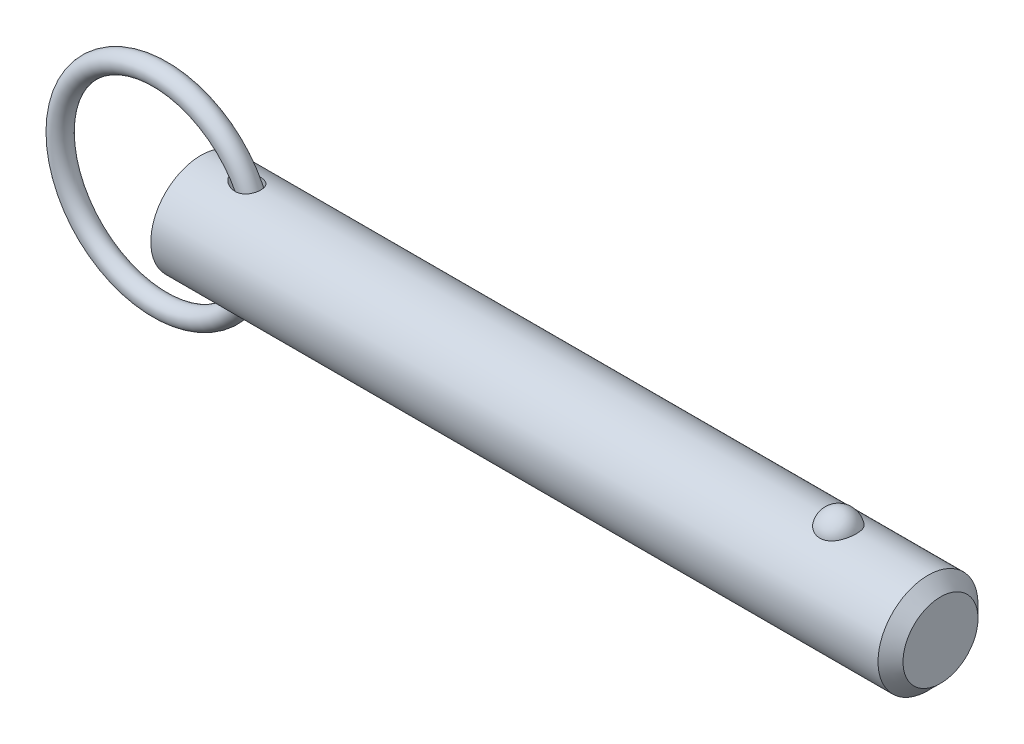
ISO-10303-21;
HEADER;
FILE_DESCRIPTION(('STEP AP214'),'2;1');
FILE_NAME('part.step','',(''),(''),'','','');
FILE_SCHEMA(('AUTOMOTIVE_DESIGN { 1 0 10303 214 1 1 1 1 }'));
ENDSEC;
DATA;
#1=APPLICATION_CONTEXT('core data for automotive mechanical design processes');
#2=APPLICATION_PROTOCOL_DEFINITION('international standard','automotive_design',2000,#1);
#3=PRODUCT_CONTEXT('',#1,'mechanical');
#4=PRODUCT('Part','Part','',(#3));
#5=PRODUCT_RELATED_PRODUCT_CATEGORY('part','',(#4));
#6=PRODUCT_DEFINITION_FORMATION('','',#4);
#7=PRODUCT_DEFINITION_CONTEXT('part definition',#1,'design');
#8=PRODUCT_DEFINITION('design','',#6,#7);
#9=PRODUCT_DEFINITION_SHAPE('','',#8);
#10=(LENGTH_UNIT() NAMED_UNIT(*) SI_UNIT(.MILLI.,.METRE.));
#11=(NAMED_UNIT(*) PLANE_ANGLE_UNIT() SI_UNIT($,.RADIAN.));
#12=(NAMED_UNIT(*) SI_UNIT($,.STERADIAN.) SOLID_ANGLE_UNIT());
#13=UNCERTAINTY_MEASURE_WITH_UNIT(LENGTH_MEASURE(1.E-05),#10,'distance_accuracy_value','');
#14=(GEOMETRIC_REPRESENTATION_CONTEXT(3) GLOBAL_UNCERTAINTY_ASSIGNED_CONTEXT((#13)) GLOBAL_UNIT_ASSIGNED_CONTEXT((#10,
#11,#12)) REPRESENTATION_CONTEXT('',''));
#15=CARTESIAN_POINT('',(0.,0.,0.));
#16=DIRECTION('',(0.,0.,1.));
#17=DIRECTION('',(1.,0.,0.));
#18=AXIS2_PLACEMENT_3D('',#15,#16,#17);
#19=CARTESIAN_POINT('',(-6.46799987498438,0.,0.));
#20=DIRECTION('',(0.,0.,1.));
#21=DIRECTION('',(1.,0.,0.));
#22=AXIS2_PLACEMENT_3D('',#19,#20,#21);
#23=TOROIDAL_SURFACE('',#22,15.875,1.588);
#24=CARTESIAN_POINT('',(10.9950001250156,0.,0.));
#25=VERTEX_POINT('',#24);
#26=VERTEX_LOOP('',#25);
#27=FACE_BOUND('',#26,.T.);
#28=ADVANCED_FACE('P0_F12',(#27),#23,.T.);
#29=CLOSED_SHELL('',(#28));
#30=MANIFOLD_SOLID_BREP('P0_B1',#29);
#31=CARTESIAN_POINT('',(0.,0.,0.));
#32=DIRECTION('',(1.,0.,0.));
#33=DIRECTION('',(0.,0.,-1.));
#34=AXIS2_PLACEMENT_3D('',#31,#32,#33);
#35=CYLINDRICAL_SURFACE('',#34,7.94);
#36=CARTESIAN_POINT('',(5.37881269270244,7.8641200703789,-1.0950869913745));
#37=CARTESIAN_POINT('',(5.49078530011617,7.84653010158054,-1.22142628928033));
#38=CARTESIAN_POINT('',(5.61742164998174,7.82766483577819,-1.33478448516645));
#39=CARTESIAN_POINT('',(5.82155225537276,7.80005811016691,-1.48501770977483));
#40=CARTESIAN_POINT('',(5.89211597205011,7.79095331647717,-1.53186949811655));
#41=CARTESIAN_POINT('',(6.03726296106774,7.77331484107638,-1.61899652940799));
#42=CARTESIAN_POINT('',(6.11184478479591,7.76478095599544,-1.65927412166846));
#43=CARTESIAN_POINT('',(6.31831542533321,7.74290334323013,-1.75933205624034));
#44=CARTESIAN_POINT('',(6.45343253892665,7.73042593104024,-1.81276183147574));
#45=CARTESIAN_POINT('',(6.73017339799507,7.70966096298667,-1.89912673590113));
#46=CARTESIAN_POINT('',(6.87179099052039,7.70136953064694,-1.93208083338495));
#47=CARTESIAN_POINT('',(7.17522096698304,7.6896684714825,-1.97820987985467));
#48=CARTESIAN_POINT('',(7.33750100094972,7.68691980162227,-1.98871513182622));
#49=CARTESIAN_POINT('',(7.5799424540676,7.68880305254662,-1.98137951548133));
#50=CARTESIAN_POINT('',(7.66059155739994,7.69043175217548,-1.97508575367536));
#51=CARTESIAN_POINT('',(7.82077465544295,7.69570110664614,-1.95445819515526));
#52=CARTESIAN_POINT('',(7.90030910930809,7.69934090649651,-1.94012781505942));
#53=CARTESIAN_POINT('',(8.092800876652,7.71066069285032,-1.89475688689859));
#54=CARTESIAN_POINT('',(8.20465204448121,7.71942251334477,-1.85909462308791));
#55=CARTESIAN_POINT('',(8.42059371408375,7.74035594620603,-1.7699066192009));
#56=CARTESIAN_POINT('',(8.52468939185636,7.75252525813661,-1.7163929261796));
#57=CARTESIAN_POINT('',(8.72211003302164,7.77903750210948,-1.59192358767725));
#58=CARTESIAN_POINT('',(8.81539818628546,7.79338749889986,-1.52091076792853));
#59=CARTESIAN_POINT('',(8.98759177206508,7.8225086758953,-1.36321590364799));
#60=CARTESIAN_POINT('',(9.06649712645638,7.83727985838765,-1.27653377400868));
#61=CARTESIAN_POINT('',(9.20311499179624,7.86453692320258,-1.09567667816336));
#62=CARTESIAN_POINT('',(9.26180839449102,7.8771064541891,-1.00225329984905));
#63=CARTESIAN_POINT('',(9.36257622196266,7.89954213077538,-0.806547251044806));
#64=CARTESIAN_POINT('',(9.40465301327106,7.9094086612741,-0.704265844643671));
#65=CARTESIAN_POINT('',(9.47062404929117,7.92520709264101,-0.495461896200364));
#66=CARTESIAN_POINT('',(9.4947881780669,7.9311972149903,-0.38902885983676));
#67=CARTESIAN_POINT('',(9.52544004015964,7.93883641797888,-0.17349446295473));
#68=CARTESIAN_POINT('',(9.53192786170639,7.94048552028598,-0.0643931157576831));
#69=CARTESIAN_POINT('',(9.52707996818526,7.93926454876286,0.153487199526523));
#70=CARTESIAN_POINT('',(9.51572796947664,7.93639034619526,0.262265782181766));
#71=CARTESIAN_POINT('',(9.47542322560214,7.92642470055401,0.47631311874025));
#72=CARTESIAN_POINT('',(9.44647056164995,7.91933327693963,0.581581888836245));
#73=CARTESIAN_POINT('',(9.37164011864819,7.90170355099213,0.785602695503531));
#74=CARTESIAN_POINT('',(9.32576415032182,7.89116561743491,0.884355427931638));
#75=CARTESIAN_POINT('',(9.21823065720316,7.8677977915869,1.07254831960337));
#76=CARTESIAN_POINT('',(9.15657431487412,7.85496807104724,1.16198917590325));
#77=CARTESIAN_POINT('',(9.01919194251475,7.82843688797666,1.32903649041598));
#78=CARTESIAN_POINT('',(8.94347744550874,7.81473614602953,1.40665255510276));
#79=CARTESIAN_POINT('',(8.78012086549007,7.7879321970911,1.5481977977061));
#80=CARTESIAN_POINT('',(8.69247914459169,7.77482897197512,1.61212739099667));
#81=CARTESIAN_POINT('',(8.50642314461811,7.75037063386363,1.72592270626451));
#82=CARTESIAN_POINT('',(8.40786430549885,7.73904540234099,1.77555777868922));
#83=CARTESIAN_POINT('',(8.20398708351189,7.71943979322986,1.85894844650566));
#84=CARTESIAN_POINT('',(8.0986670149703,7.7111601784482,1.89270006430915));
#85=CARTESIAN_POINT('',(7.87703213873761,7.69782475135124,1.94625652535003));
#86=CARTESIAN_POINT('',(7.76044899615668,7.69301557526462,1.96500324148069));
#87=CARTESIAN_POINT('',(7.52574256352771,7.68770484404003,1.98567257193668));
#88=CARTESIAN_POINT('',(7.40761868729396,7.68720497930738,1.98758858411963));
#89=CARTESIAN_POINT('',(7.15639592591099,7.69044495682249,1.97502233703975));
#90=CARTESIAN_POINT('',(7.02341871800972,7.69476380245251,1.9583009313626));
#91=CARTESIAN_POINT('',(6.76125891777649,7.70776394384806,1.90648094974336));
#92=CARTESIAN_POINT('',(6.63208047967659,7.71644984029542,1.87136299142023));
#93=CARTESIAN_POINT('',(6.35978215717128,7.73875442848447,1.77707737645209));
#94=CARTESIAN_POINT('',(6.2177212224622,7.75293863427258,1.71496895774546));
#95=CARTESIAN_POINT('',(5.94559201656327,7.78383102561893,1.56880760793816));
#96=CARTESIAN_POINT('',(5.81552062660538,7.80053855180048,1.48476040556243));
#97=CARTESIAN_POINT('',(5.60081087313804,7.83035955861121,1.31701356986));
#98=CARTESIAN_POINT('',(5.51265224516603,7.84340226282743,1.23780647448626));
#99=CARTESIAN_POINT('',(5.34976240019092,7.86852524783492,1.06647953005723));
#100=CARTESIAN_POINT('',(5.27500719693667,7.88060722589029,0.974383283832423));
#101=CARTESIAN_POINT('',(5.15877594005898,7.89990441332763,0.800548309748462));
#102=CARTESIAN_POINT('',(5.11360209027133,7.90759876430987,0.721348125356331));
#103=CARTESIAN_POINT('',(5.03655060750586,7.92090267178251,0.556518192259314));
#104=CARTESIAN_POINT('',(5.00466157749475,7.92651401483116,0.470894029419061));
#105=CARTESIAN_POINT('',(4.95653766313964,7.93503671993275,0.294356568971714));
#106=CARTESIAN_POINT('',(4.94043621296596,7.93792505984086,0.203404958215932));
#107=CARTESIAN_POINT('',(4.92605720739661,7.94050250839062,0.0200631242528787));
#108=CARTESIAN_POINT('',(4.92776929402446,7.9401934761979,-0.0723262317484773));
#109=CARTESIAN_POINT('',(4.94742735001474,7.93667454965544,-0.243250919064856));
#110=CARTESIAN_POINT('',(4.96327131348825,7.93384031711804,-0.322048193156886));
#111=CARTESIAN_POINT('',(5.00707570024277,7.92609115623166,-0.476058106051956));
#112=CARTESIAN_POINT('',(5.03503965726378,7.92117562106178,-0.55126969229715));
#113=CARTESIAN_POINT('',(5.10737112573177,7.90866290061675,-0.709995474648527));
#114=CARTESIAN_POINT('',(5.15379379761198,7.90074105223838,-0.792541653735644));
#115=CARTESIAN_POINT('',(5.25820836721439,7.88338732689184,-0.949781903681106));
#116=CARTESIAN_POINT('',(5.31621941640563,7.87395295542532,-1.02446265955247));
#117=CARTESIAN_POINT('',(5.37881269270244,7.8641200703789,-1.0950869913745));
#118=B_SPLINE_CURVE_WITH_KNOTS('',3,(#36,#37,#38,#39,#40,#41,#42,#43,#44,#45,#46,#47,#48,#49,
#50,#51,#52,#53,#54,#55,#56,#57,#58,#59,#60,#61,#62,#63,#64,#65,#66,#67,#68,#69,#70,#71,#72,#73,
#74,#75,#76,#77,#78,#79,#80,#81,#82,#83,#84,#85,#86,#87,#88,#89,#90,#91,#92,#93,#94,#95,#96,#97,
#98,#99,#100,#101,#102,#103,#104,#105,#106,#107,#108,#109,#110,#111,#112,#113,#114,#115,#116,
#117),.UNSPECIFIED.,.T.,.F.,(4,2,2,2,2,2,2,2,2,2,2,2,2,2,2,2,2,2,2,2,2,2,2,2,2,2,2,2,2,2,2,2,2,
2,2,2,2,2,2,2,4),(0.,0.508599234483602,0.763935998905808,1.01918131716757,1.45492798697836,
1.89027038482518,2.37502798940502,2.61739702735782,2.8596631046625,3.21120678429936,
3.56251370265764,3.91498401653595,4.26745624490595,4.59897839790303,4.93045331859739,
5.25682643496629,5.58319792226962,5.909867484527,6.23653553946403,6.56316865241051,
6.88977729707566,7.21611917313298,7.54245114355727,7.87378632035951,8.20520442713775,
8.55832700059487,8.91158808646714,9.31234018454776,9.71351536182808,10.1786231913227,
10.6436096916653,11.0001264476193,11.3559986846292,11.6294791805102,11.9027245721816,
12.1782599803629,12.4536351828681,12.693828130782,12.9340911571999,13.2179277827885,
13.5022374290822),.UNSPECIFIED.);
#119=CARTESIAN_POINT('',(5.37881269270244,7.8641200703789,-1.0950869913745));
#120=VERTEX_POINT('',#119);
#121=EDGE_CURVE('P1_E40',#120,#120,#118,.T.);
#122=ORIENTED_EDGE('',*,*,#121,.T.);
#123=EDGE_LOOP('',(#122));
#124=FACE_BOUND('',#123,.T.);
#125=CARTESIAN_POINT('',(115.495,0.,0.));
#126=DIRECTION('',(1.,0.,0.));
#127=DIRECTION('',(0.,0.,-1.));
#128=AXIS2_PLACEMENT_3D('',#125,#126,#127);
#129=CIRCLE('',#128,7.94);
#130=CARTESIAN_POINT('',(115.495,0.,-7.94));
#131=VERTEX_POINT('',#130);
#132=EDGE_CURVE('P1_E25',#131,#131,#129,.T.);
#133=ORIENTED_EDGE('',*,*,#132,.F.);
#134=EDGE_LOOP('',(#133));
#135=FACE_BOUND('',#134,.T.);
#136=CARTESIAN_POINT('',(0.,0.,0.));
#137=DIRECTION('',(1.,0.,0.));
#138=DIRECTION('',(0.,0.,-1.));
#139=AXIS2_PLACEMENT_3D('',#136,#137,#138);
#140=CIRCLE('',#139,7.94);
#141=CARTESIAN_POINT('',(0.,0.,-7.94));
#142=VERTEX_POINT('',#141);
#143=EDGE_CURVE('P1_E9',#142,#142,#140,.T.);
#144=ORIENTED_EDGE('',*,*,#143,.T.);
#145=EDGE_LOOP('',(#144));
#146=FACE_BOUND('',#145,.T.);
#147=CARTESIAN_POINT('',(101.264907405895,7.37767842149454,2.93486986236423));
#148=CARTESIAN_POINT('',(101.112749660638,7.3776732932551,2.93487505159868));
#149=CARTESIAN_POINT('',(100.960632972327,7.38258419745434,2.92262454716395));
#150=CARTESIAN_POINT('',(100.660928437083,7.40163229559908,2.87404196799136));
#151=CARTESIAN_POINT('',(100.513339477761,7.41576720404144,2.83771585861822));
#152=CARTESIAN_POINT('',(100.227018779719,7.4516157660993,2.74218769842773));
#153=CARTESIAN_POINT('',(100.088274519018,7.47331841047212,2.68301886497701));
#154=CARTESIAN_POINT('',(99.8228822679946,7.52194082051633,2.54350967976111));
#155=CARTESIAN_POINT('',(99.6962366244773,7.5488615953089,2.46316523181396));
#156=CARTESIAN_POINT('',(99.4545349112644,7.60594671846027,2.2809037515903));
#157=CARTESIAN_POINT('',(99.3399065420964,7.63618114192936,2.17844211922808));
#158=CARTESIAN_POINT('',(99.1288787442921,7.69614046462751,1.95608495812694));
#159=CARTESIAN_POINT('',(99.0324826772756,7.72586526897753,1.83618622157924));
#160=CARTESIAN_POINT('',(98.8559381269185,7.78314821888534,1.57628086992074));
#161=CARTESIAN_POINT('',(98.7767072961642,7.81055035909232,1.43561546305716));
#162=CARTESIAN_POINT('',(98.6417979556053,7.85879631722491,1.14236334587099));
#163=CARTESIAN_POINT('',(98.5861216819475,7.87963951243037,0.989775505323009));
#164=CARTESIAN_POINT('',(98.4988121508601,7.91289645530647,0.674619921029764));
#165=CARTESIAN_POINT('',(98.4675309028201,7.925186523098,0.511941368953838));
#166=CARTESIAN_POINT('',(98.430975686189,7.93958930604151,0.183247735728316));
#167=CARTESIAN_POINT('',(98.4257012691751,7.94170219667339,0.0172327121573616));
#168=CARTESIAN_POINT('',(98.4412311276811,7.93554931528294,-0.312672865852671));
#169=CARTESIAN_POINT('',(98.4619253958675,7.92732732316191,-0.4765694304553));
#170=CARTESIAN_POINT('',(98.5287865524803,7.90141534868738,-0.798305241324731));
#171=CARTESIAN_POINT('',(98.5749539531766,7.88372517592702,-0.956144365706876));
#172=CARTESIAN_POINT('',(98.6918986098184,7.84066230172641,-1.26152073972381));
#173=CARTESIAN_POINT('',(98.7627046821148,7.81528060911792,-1.40904568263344));
#174=CARTESIAN_POINT('',(98.9274789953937,7.7594867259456,-1.68950598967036));
#175=CARTESIAN_POINT('',(99.0214488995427,7.72907417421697,-1.82244030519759));
#176=CARTESIAN_POINT('',(99.2308391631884,7.66640424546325,-2.07032792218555));
#177=CARTESIAN_POINT('',(99.3463152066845,7.63414223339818,-2.1852330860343));
#178=CARTESIAN_POINT('',(99.5959006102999,7.57149681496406,-2.39329737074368));
#179=CARTESIAN_POINT('',(99.7300080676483,7.54111321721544,-2.48645870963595));
#180=CARTESIAN_POINT('',(100.010111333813,7.48650742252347,-2.64628132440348));
#181=CARTESIAN_POINT('',(100.155760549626,7.46215900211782,-2.71350554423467));
#182=CARTESIAN_POINT('',(100.457425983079,7.42171253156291,-2.82226614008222));
#183=CARTESIAN_POINT('',(100.613438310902,7.40561140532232,-2.86381209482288));
#184=CARTESIAN_POINT('',(100.922970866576,7.3842679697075,-2.9183907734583));
#185=CARTESIAN_POINT('',(101.076222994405,7.37852109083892,-2.93275024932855));
#186=CARTESIAN_POINT('',(101.383070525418,7.37700973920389,-2.93655208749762));
#187=CARTESIAN_POINT('',(101.536665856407,7.38124333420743,-2.92599927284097));
#188=CARTESIAN_POINT('',(101.834990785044,7.39890635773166,-2.88102897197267));
#189=CARTESIAN_POINT('',(101.979848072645,7.41205491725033,-2.84733999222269));
#190=CARTESIAN_POINT('',(102.26164329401,7.445801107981,-2.75788206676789));
#191=CARTESIAN_POINT('',(102.398580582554,7.46639934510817,-2.70211132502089));
#192=CARTESIAN_POINT('',(102.664061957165,7.51339098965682,-2.56858908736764));
#193=CARTESIAN_POINT('',(102.792354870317,7.53990200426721,-2.49038067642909));
#194=CARTESIAN_POINT('',(103.034244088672,7.59569503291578,-2.31462737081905));
#195=CARTESIAN_POINT('',(103.147837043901,7.62497767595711,-2.21707808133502));
#196=CARTESIAN_POINT('',(103.36322156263,7.68489473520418,-1.99982049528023));
#197=CARTESIAN_POINT('',(103.464148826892,7.71552419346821,-1.87925337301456));
#198=CARTESIAN_POINT('',(103.645186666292,7.77353016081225,-1.62268826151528));
#199=CARTESIAN_POINT('',(103.725293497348,7.80090608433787,-1.4866875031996));
#200=CARTESIAN_POINT('',(103.865361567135,7.85047992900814,-1.19818413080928));
#201=CARTESIAN_POINT('',(103.924587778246,7.8724818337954,-1.04529016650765));
#202=CARTESIAN_POINT('',(104.017982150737,7.90785114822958,-0.731080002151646));
#203=CARTESIAN_POINT('',(104.052149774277,7.92121837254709,-0.569763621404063));
#204=CARTESIAN_POINT('',(104.094795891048,7.93797834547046,-0.242812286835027));
#205=CARTESIAN_POINT('',(104.103204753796,7.94134405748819,-0.0771668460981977));
#206=CARTESIAN_POINT('',(104.093962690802,7.93767937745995,0.253276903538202));
#207=CARTESIAN_POINT('',(104.076312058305,7.93064910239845,0.418075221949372));
#208=CARTESIAN_POINT('',(104.015424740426,7.90695571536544,0.741525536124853));
#209=CARTESIAN_POINT('',(103.972281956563,7.8903279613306,0.900197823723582));
#210=CARTESIAN_POINT('',(103.86135358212,7.84916386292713,1.20759654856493));
#211=CARTESIAN_POINT('',(103.79356656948,7.82462706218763,1.35632241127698));
#212=CARTESIAN_POINT('',(103.634371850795,7.7700669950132,1.64032869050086));
#213=CARTESIAN_POINT('',(103.542861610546,7.7400200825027,1.77554712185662));
#214=CARTESIAN_POINT('',(103.338296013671,7.67774175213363,2.02800648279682));
#215=CARTESIAN_POINT('',(103.225241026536,7.64551037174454,2.14524772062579));
#216=CARTESIAN_POINT('',(102.980831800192,7.58265895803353,2.35778002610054));
#217=CARTESIAN_POINT('',(102.849583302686,7.55203092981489,2.45319004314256));
#218=CARTESIAN_POINT('',(102.571601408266,7.49579792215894,2.61999897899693));
#219=CARTESIAN_POINT('',(102.424867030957,7.47019326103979,2.69139637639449));
#220=CARTESIAN_POINT('',(102.112947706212,7.42622216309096,2.8105324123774));
#221=CARTESIAN_POINT('',(101.947220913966,7.40825002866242,2.85700910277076));
#222=CARTESIAN_POINT('',(101.609279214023,7.38398348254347,2.9191685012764));
#223=CARTESIAN_POINT('',(101.43706702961,7.3776842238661,2.93486399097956));
#224=CARTESIAN_POINT('',(101.264907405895,7.37767842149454,2.93486986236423));
#225=B_SPLINE_CURVE_WITH_KNOTS('',3,(#147,#148,#149,#150,#151,#152,#153,#154,#155,#156,#157,
#158,#159,#160,#161,#162,#163,#164,#165,#166,#167,#168,#169,#170,#171,#172,#173,#174,#175,#176,
#177,#178,#179,#180,#181,#182,#183,#184,#185,#186,#187,#188,#189,#190,#191,#192,#193,#194,#195,
#196,#197,#198,#199,#200,#201,#202,#203,#204,#205,#206,#207,#208,#209,#210,#211,#212,#213,#214,
#215,#216,#217,#218,#219,#220,#221,#222,#223,#224),.UNSPECIFIED.,.T.,.F.,(4,2,2,2,2,2,2,2,2,2,2,
2,2,2,2,2,2,2,2,2,2,2,2,2,2,2,2,2,2,2,2,2,2,2,2,2,2,2,4),(0.,0.45584132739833,0.911569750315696,
1.36663794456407,1.8217942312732,2.28978983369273,2.7578716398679,3.246853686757,
3.73588214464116,4.23184282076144,4.72779494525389,5.22165321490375,5.71552141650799,
6.20996917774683,6.70445245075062,7.20023431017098,7.69596557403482,8.18023418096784,
8.66432203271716,9.12410697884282,9.58380291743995,10.0296503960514,10.4755341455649,
10.9312349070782,11.3870393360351,11.8654416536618,12.3439299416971,12.8378875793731,
13.3318558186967,13.8271581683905,14.3224549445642,14.8159385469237,15.3094506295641,
15.8051323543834,16.3008055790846,16.7937101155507,17.2866458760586,17.8026240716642,
18.3183879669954),.UNSPECIFIED.);
#226=CARTESIAN_POINT('',(101.264907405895,7.37767842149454,2.93486986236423));
#227=VERTEX_POINT('',#226);
#228=EDGE_CURVE('P1_E34',#227,#227,#225,.T.);
#229=ORIENTED_EDGE('',*,*,#228,.T.);
#230=EDGE_LOOP('',(#229));
#231=FACE_BOUND('',#230,.T.);
#232=CARTESIAN_POINT('',(5.37881269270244,-7.8641200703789,-1.0950869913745));
#233=CARTESIAN_POINT('',(5.31532711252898,-7.87409326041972,-1.02345575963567));
#234=CARTESIAN_POINT('',(5.25654962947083,-7.88365715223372,-0.947641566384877));
#235=CARTESIAN_POINT('',(5.15093536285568,-7.90122221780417,-0.787865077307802));
#236=CARTESIAN_POINT('',(5.10408931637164,-7.90922460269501,-0.703909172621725));
#237=CARTESIAN_POINT('',(5.02499142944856,-7.92292057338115,-0.5279916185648));
#238=CARTESIAN_POINT('',(4.99290048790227,-7.92858863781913,-0.435954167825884));
#239=CARTESIAN_POINT('',(4.94718343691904,-7.93670712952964,-0.247266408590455));
#240=CARTESIAN_POINT('',(4.93353142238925,-7.93916207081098,-0.150622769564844));
#241=CARTESIAN_POINT('',(4.92669426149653,-7.94038957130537,0.0306459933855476));
#242=CARTESIAN_POINT('',(4.9310562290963,-7.93960347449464,0.115182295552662));
#243=CARTESIAN_POINT('',(4.95441758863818,-7.93542535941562,0.2821331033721));
#244=CARTESIAN_POINT('',(4.97342060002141,-7.93203269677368,0.364547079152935));
#245=CARTESIAN_POINT('',(5.02337664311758,-7.92322764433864,0.521528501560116));
#246=CARTESIAN_POINT('',(5.05377582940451,-7.91790920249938,0.596281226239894));
#247=CARTESIAN_POINT('',(5.1246872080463,-7.90571364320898,0.740640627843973));
#248=CARTESIAN_POINT('',(5.16520358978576,-7.89883588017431,0.810245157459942));
#249=CARTESIAN_POINT('',(5.27792634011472,-7.88012470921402,0.97862022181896));
#250=CARTESIAN_POINT('',(5.35563200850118,-7.86757912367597,1.07363778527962));
#251=CARTESIAN_POINT('',(5.52523836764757,-7.84150676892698,1.24994147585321));
#252=CARTESIAN_POINT('',(5.61717506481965,-7.82797755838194,1.33119164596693));
#253=CARTESIAN_POINT('',(5.83913717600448,-7.79742756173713,1.50104748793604));
#254=CARTESIAN_POINT('',(5.97257429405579,-7.78050347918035,1.58521567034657));
#255=CARTESIAN_POINT('',(6.25160600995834,-7.74942135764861,1.73078109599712));
#256=CARTESIAN_POINT('',(6.39720857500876,-7.73526515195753,1.79216327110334));
#257=CARTESIAN_POINT('',(6.69793322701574,-7.7116170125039,1.89134478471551));
#258=CARTESIAN_POINT('',(6.85312134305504,-7.70216275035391,1.92895428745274));
#259=CARTESIAN_POINT('',(7.16781951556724,-7.68988337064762,1.97736316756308));
#260=CARTESIAN_POINT('',(7.32732244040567,-7.68704791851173,1.98820434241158));
#261=CARTESIAN_POINT('',(7.61290770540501,-7.68890797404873,1.98097687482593));
#262=CARTESIAN_POINT('',(7.73913797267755,-7.69217875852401,1.96837928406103));
#263=CARTESIAN_POINT('',(7.98774248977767,-7.70364253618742,1.92303262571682));
#264=CARTESIAN_POINT('',(8.11011880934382,-7.71183283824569,1.89029457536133));
#265=CARTESIAN_POINT('',(8.34766306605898,-7.73253074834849,1.80375920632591));
#266=CARTESIAN_POINT('',(8.46278682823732,-7.74506226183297,1.74984505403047));
#267=CARTESIAN_POINT('',(8.6806268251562,-7.77294147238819,1.62149891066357));
#268=CARTESIAN_POINT('',(8.78334736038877,-7.78828818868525,1.54707406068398));
#269=CARTESIAN_POINT('',(8.96275951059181,-7.81808719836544,1.38814746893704));
#270=CARTESIAN_POINT('',(9.04102925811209,-7.83247448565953,1.30540890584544));
#271=CARTESIAN_POINT('',(9.18176824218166,-7.86008608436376,1.1272733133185));
#272=CARTESIAN_POINT('',(9.24424163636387,-7.87331070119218,1.03187962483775));
#273=CARTESIAN_POINT('',(9.34924815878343,-7.89649032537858,0.83568428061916));
#274=CARTESIAN_POINT('',(9.39252490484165,-7.90656172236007,0.735293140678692));
#275=CARTESIAN_POINT('',(9.46188913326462,-7.92307290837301,0.528458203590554));
#276=CARTESIAN_POINT('',(9.48797767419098,-7.92951292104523,0.422014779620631));
#277=CARTESIAN_POINT('',(9.52228670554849,-7.93804067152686,0.206589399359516));
#278=CARTESIAN_POINT('',(9.53058328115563,-7.94014694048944,0.0976202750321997));
#279=CARTESIAN_POINT('',(9.52935292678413,-7.93983698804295,-0.120212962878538));
#280=CARTESIAN_POINT('',(9.51982577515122,-7.93742071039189,-0.229077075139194));
#281=CARTESIAN_POINT('',(9.48313466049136,-7.92831916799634,-0.443751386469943));
#282=CARTESIAN_POINT('',(9.45594838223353,-7.92162850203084,-0.549557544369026));
#283=CARTESIAN_POINT('',(9.38454658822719,-7.90469917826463,-0.754954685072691));
#284=CARTESIAN_POINT('',(9.34033171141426,-7.89446065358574,-0.854545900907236));
#285=CARTESIAN_POINT('',(9.23602927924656,-7.87157146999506,-1.04456732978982));
#286=CARTESIAN_POINT('',(9.17596171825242,-7.85892385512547,-1.13500888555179));
#287=CARTESIAN_POINT('',(9.0415343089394,-7.83259746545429,-1.30436780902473));
#288=CARTESIAN_POINT('',(8.96717562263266,-7.81891877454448,-1.38328611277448));
#289=CARTESIAN_POINT('',(8.80603455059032,-7.79196869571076,-1.52782923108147));
#290=CARTESIAN_POINT('',(8.71921490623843,-7.77869867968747,-1.59341269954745));
#291=CARTESIAN_POINT('',(8.53589430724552,-7.7539823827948,-1.7096493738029));
#292=CARTESIAN_POINT('',(8.43939269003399,-7.74253622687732,-1.76030155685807));
#293=CARTESIAN_POINT('',(8.23614706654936,-7.72219212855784,-1.84754820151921));
#294=CARTESIAN_POINT('',(8.1291686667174,-7.71339202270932,-1.88361685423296));
#295=CARTESIAN_POINT('',(7.91082287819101,-7.69955300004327,-1.93940887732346));
#296=CARTESIAN_POINT('',(7.79945379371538,-7.69451555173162,-1.95912586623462));
#297=CARTESIAN_POINT('',(7.56409927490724,-7.6881073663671,-1.98413612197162));
#298=CARTESIAN_POINT('',(7.43993744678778,-7.68713944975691,-1.98784574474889));
#299=CARTESIAN_POINT('',(7.19239878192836,-7.68969629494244,-1.97792309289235));
#300=CARTESIAN_POINT('',(7.0690222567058,-7.69322274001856,-1.96428432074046));
#301=CARTESIAN_POINT('',(6.80624991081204,-7.70498367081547,-1.91768089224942));
#302=CARTESIAN_POINT('',(6.66736121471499,-7.71386737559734,-1.88203087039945));
#303=CARTESIAN_POINT('',(6.39625444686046,-7.73551250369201,-1.79098714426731));
#304=CARTESIAN_POINT('',(6.26404857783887,-7.74828074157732,-1.73555871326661));
#305=CARTESIAN_POINT('',(6.06559048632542,-7.77003865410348,-1.63446133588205));
#306=CARTESIAN_POINT('',(5.99591479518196,-7.77821880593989,-1.59522999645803));
#307=CARTESIAN_POINT('',(5.86025875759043,-7.79503524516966,-1.51091846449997));
#308=CARTESIAN_POINT('',(5.79427944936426,-7.8036716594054,-1.46583664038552));
#309=CARTESIAN_POINT('',(5.60322733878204,-7.82978128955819,-1.3219827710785));
#310=CARTESIAN_POINT('',(5.4844964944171,-7.84751780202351,-1.21433077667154));
#311=CARTESIAN_POINT('',(5.37881269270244,-7.8641200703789,-1.0950869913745));
#312=B_SPLINE_CURVE_WITH_KNOTS('',3,(#232,#233,#234,#235,#236,#237,#238,#239,#240,#241,#242,
#243,#244,#245,#246,#247,#248,#249,#250,#251,#252,#253,#254,#255,#256,#257,#258,#259,#260,#261,
#262,#263,#264,#265,#266,#267,#268,#269,#270,#271,#272,#273,#274,#275,#276,#277,#278,#279,#280,
#281,#282,#283,#284,#285,#286,#287,#288,#289,#290,#291,#292,#293,#294,#295,#296,#297,#298,#299,
#300,#301,#302,#303,#304,#305,#306,#307,#308,#309,#310,#311),.UNSPECIFIED.,.T.,.F.,(4,2,2,2,2,2,
2,2,2,2,2,2,2,2,2,2,2,2,2,2,2,2,2,2,2,2,2,2,2,2,2,2,2,2,2,2,2,2,2,4),(0.,0.288363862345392,
0.576503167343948,0.867714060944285,1.15851540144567,1.41111828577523,1.66378363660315,
1.90549406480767,2.1473047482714,2.51540453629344,2.88445136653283,3.35805159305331,
3.83196445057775,4.30961543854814,4.78652012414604,5.16565662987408,5.54458592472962,
5.92563591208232,6.30655339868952,6.64920782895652,6.99177197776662,7.31956587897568,
7.64733959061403,7.97370879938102,8.30008206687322,8.62686856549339,8.95364280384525,
9.28000684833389,9.60634436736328,9.93367879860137,10.261035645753,10.59932199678,
10.9377403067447,11.308967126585,11.6803330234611,12.1096921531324,12.5398088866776,
12.7806650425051,13.0215885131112,13.5016249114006),.UNSPECIFIED.);
#313=CARTESIAN_POINT('',(5.37881269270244,-7.8641200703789,-1.0950869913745));
#314=VERTEX_POINT('',#313);
#315=EDGE_CURVE('P1_E17',#314,#314,#312,.T.);
#316=ORIENTED_EDGE('',*,*,#315,.T.);
#317=EDGE_LOOP('',(#316));
#318=FACE_BOUND('',#317,.T.);
#319=ADVANCED_FACE('P1_F13',(#124,#135,#146,#231,#318),#35,.T.);
#320=CARTESIAN_POINT('',(0.,0.,0.));
#321=DIRECTION('',(-1.,0.,0.));
#322=DIRECTION('',(0.,0.,1.));
#323=AXIS2_PLACEMENT_3D('',#320,#321,#322);
#324=PLANE('',#323);
#325=ORIENTED_EDGE('',*,*,#143,.F.);
#326=EDGE_LOOP('',(#325));
#327=FACE_BOUND('',#326,.T.);
#328=ADVANCED_FACE('P1_F15',(#327),#324,.T.);
#329=CARTESIAN_POINT('',(117.48,0.,0.));
#330=DIRECTION('',(-1.,0.,0.));
#331=DIRECTION('',(0.,0.,1.));
#332=AXIS2_PLACEMENT_3D('',#329,#330,#331);
#333=CONICAL_SURFACE('',#332,5.95500000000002,0.785398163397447);
#334=ORIENTED_EDGE('',*,*,#132,.T.);
#335=EDGE_LOOP('',(#334));
#336=FACE_BOUND('',#335,.T.);
#337=CARTESIAN_POINT('',(117.48,0.,0.));
#338=DIRECTION('',(1.,0.,0.));
#339=DIRECTION('',(0.,0.,-1.));
#340=AXIS2_PLACEMENT_3D('',#337,#338,#339);
#341=CIRCLE('',#340,5.95500000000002);
#342=CARTESIAN_POINT('',(117.48,0.,-5.95500000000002));
#343=VERTEX_POINT('',#342);
#344=EDGE_CURVE('P1_E30',#343,#343,#341,.T.);
#345=ORIENTED_EDGE('',*,*,#344,.F.);
#346=EDGE_LOOP('',(#345));
#347=FACE_BOUND('',#346,.T.);
#348=ADVANCED_FACE('P1_F55',(#336,#347),#333,.T.);
#349=CARTESIAN_POINT('',(117.48,5.95500000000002,0.));
#350=DIRECTION('',(1.,0.,0.));
#351=DIRECTION('',(0.,0.,-1.));
#352=AXIS2_PLACEMENT_3D('',#349,#350,#351);
#353=PLANE('',#352);
#354=ORIENTED_EDGE('',*,*,#344,.T.);
#355=EDGE_LOOP('',(#354));
#356=FACE_BOUND('',#355,.T.);
#357=ADVANCED_FACE('P1_F51',(#356),#353,.T.);
#358=CARTESIAN_POINT('',(101.264907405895,7.14599999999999,0.));
#359=DIRECTION('',(-1.,0.,0.));
#360=DIRECTION('',(0.,1.,0.));
#361=AXIS2_PLACEMENT_3D('',#358,#359,#360);
#362=SPHERICAL_SURFACE('',#361,2.944);
#363=ORIENTED_EDGE('',*,*,#228,.F.);
#364=EDGE_LOOP('',(#363));
#365=FACE_BOUND('',#364,.T.);
#366=ADVANCED_FACE('P1_F46',(#365),#362,.T.);
#367=CARTESIAN_POINT('',(-6.46799987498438,0.,0.));
#368=DIRECTION('',(0.,0.,1.));
#369=DIRECTION('',(1.,0.,0.));
#370=AXIS2_PLACEMENT_3D('',#367,#368,#369);
#371=TOROIDAL_SURFACE('',#370,15.875,1.985);
#372=ORIENTED_EDGE('',*,*,#315,.F.);
#373=EDGE_LOOP('',(#372));
#374=FACE_BOUND('',#373,.T.);
#375=ORIENTED_EDGE('',*,*,#121,.F.);
#376=EDGE_LOOP('',(#375));
#377=FACE_BOUND('',#376,.T.);
#378=ADVANCED_FACE('P1_F50',(#374,#377),#371,.F.);
#379=CLOSED_SHELL('',(#319,#328,#348,#357,#366,#378));
#380=MANIFOLD_SOLID_BREP('P1_B1',#379);
#381=ADVANCED_BREP_SHAPE_REPRESENTATION('',(#18,#30,#380),#14);
#382=SHAPE_DEFINITION_REPRESENTATION(#9,#381);
ENDSEC;
END-ISO-10303-21;
